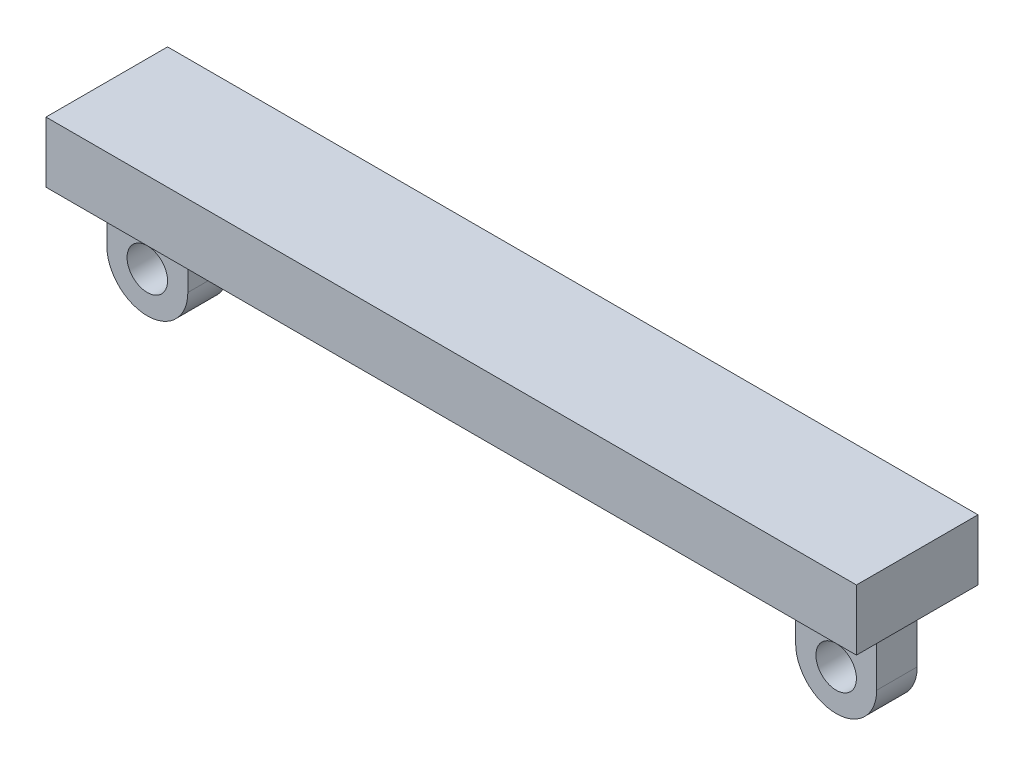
ISO-10303-21;
HEADER;
FILE_DESCRIPTION(('STEP AP214'),'2;1');
FILE_NAME('part.step','',(''),(''),'','','');
FILE_SCHEMA(('AUTOMOTIVE_DESIGN { 1 0 10303 214 1 1 1 1 }'));
ENDSEC;
DATA;
#1=APPLICATION_CONTEXT('core data for automotive mechanical design processes');
#2=APPLICATION_PROTOCOL_DEFINITION('international standard','automotive_design',2000,#1);
#3=PRODUCT_CONTEXT('',#1,'mechanical');
#4=PRODUCT('Part','Part','',(#3));
#5=PRODUCT_RELATED_PRODUCT_CATEGORY('part','',(#4));
#6=PRODUCT_DEFINITION_FORMATION('','',#4);
#7=PRODUCT_DEFINITION_CONTEXT('part definition',#1,'design');
#8=PRODUCT_DEFINITION('design','',#6,#7);
#9=PRODUCT_DEFINITION_SHAPE('','',#8);
#10=(LENGTH_UNIT() NAMED_UNIT(*) SI_UNIT(.MILLI.,.METRE.));
#11=(NAMED_UNIT(*) PLANE_ANGLE_UNIT() SI_UNIT($,.RADIAN.));
#12=(NAMED_UNIT(*) SI_UNIT($,.STERADIAN.) SOLID_ANGLE_UNIT());
#13=UNCERTAINTY_MEASURE_WITH_UNIT(LENGTH_MEASURE(1.E-05),#10,'distance_accuracy_value','');
#14=(GEOMETRIC_REPRESENTATION_CONTEXT(3) GLOBAL_UNCERTAINTY_ASSIGNED_CONTEXT((#13)) GLOBAL_UNIT_ASSIGNED_CONTEXT((#10,
#11,#12)) REPRESENTATION_CONTEXT('',''));
#15=CARTESIAN_POINT('',(0.,0.,0.));
#16=DIRECTION('',(0.,0.,1.));
#17=DIRECTION('',(1.,0.,0.));
#18=AXIS2_PLACEMENT_3D('',#15,#16,#17);
#19=CARTESIAN_POINT('',(190.,-80.,10.));
#20=DIRECTION('',(0.,0.,1.));
#21=DIRECTION('',(1.,0.,0.));
#22=AXIS2_PLACEMENT_3D('',#19,#20,#21);
#23=PLANE('',#22);
#24=DIRECTION('',(0.,1.,0.));
#25=VECTOR('',#24,1.);
#26=CARTESIAN_POINT('',(150.,-80.,10.));
#27=LINE('',#26,#25);
#28=CARTESIAN_POINT('',(150.,-60.,10.));
#29=VERTEX_POINT('',#28);
#30=CARTESIAN_POINT('',(150.,-35.,10.));
#31=VERTEX_POINT('',#30);
#32=EDGE_CURVE('E299',#29,#31,#27,.T.);
#33=ORIENTED_EDGE('',*,*,#32,.F.);
#34=CARTESIAN_POINT('',(170.,-60.,10.));
#35=DIRECTION('',(0.,0.,1.));
#36=DIRECTION('',(1.,0.,0.));
#37=AXIS2_PLACEMENT_3D('',#34,#35,#36);
#38=CIRCLE('',#37,20.);
#39=CARTESIAN_POINT('',(170.,-80.,10.));
#40=VERTEX_POINT('',#39);
#41=EDGE_CURVE('E249',#29,#40,#38,.T.);
#42=ORIENTED_EDGE('',*,*,#41,.T.);
#43=CARTESIAN_POINT('',(170.,-60.,10.));
#44=DIRECTION('',(0.,0.,1.));
#45=DIRECTION('',(1.,0.,0.));
#46=AXIS2_PLACEMENT_3D('',#43,#44,#45);
#47=CIRCLE('',#46,20.);
#48=CARTESIAN_POINT('',(190.,-60.,10.));
#49=VERTEX_POINT('',#48);
#50=EDGE_CURVE('E247',#40,#49,#47,.T.);
#51=ORIENTED_EDGE('',*,*,#50,.T.);
#52=DIRECTION('',(0.,1.,0.));
#53=VECTOR('',#52,1.);
#54=CARTESIAN_POINT('',(190.,-80.,10.));
#55=LINE('',#54,#53);
#56=CARTESIAN_POINT('',(190.,-35.,10.));
#57=VERTEX_POINT('',#56);
#58=EDGE_CURVE('E276',#49,#57,#55,.T.);
#59=ORIENTED_EDGE('',*,*,#58,.T.);
#60=CARTESIAN_POINT('',(195.,-35.,10.));
#61=DIRECTION('',(0.,0.,1.));
#62=DIRECTION('',(1.,0.,0.));
#63=AXIS2_PLACEMENT_3D('',#60,#61,#62);
#64=CIRCLE('',#63,5.);
#65=CARTESIAN_POINT('',(195.,-30.,10.));
#66=VERTEX_POINT('',#65);
#67=EDGE_CURVE('E268',#57,#66,#64,.F.);
#68=ORIENTED_EDGE('',*,*,#67,.T.);
#69=DIRECTION('',(1.,0.,0.));
#70=VECTOR('',#69,1.);
#71=CARTESIAN_POINT('',(190.,-30.,10.));
#72=LINE('',#71,#70);
#73=CARTESIAN_POINT('',(145.,-30.,10.));
#74=VERTEX_POINT('',#73);
#75=EDGE_CURVE('E274',#74,#66,#72,.T.);
#76=ORIENTED_EDGE('',*,*,#75,.F.);
#77=CARTESIAN_POINT('',(145.,-35.,10.));
#78=DIRECTION('',(0.,0.,1.));
#79=DIRECTION('',(1.,0.,0.));
#80=AXIS2_PLACEMENT_3D('',#77,#78,#79);
#81=CIRCLE('',#80,5.);
#82=EDGE_CURVE('E40',#74,#31,#81,.F.);
#83=ORIENTED_EDGE('',*,*,#82,.T.);
#84=EDGE_LOOP('',(#33,#42,#51,#59,#68,#76,#83));
#85=FACE_BOUND('',#84,.T.);
#86=CARTESIAN_POINT('',(170.,-60.,10.));
#87=DIRECTION('',(0.,0.,1.));
#88=DIRECTION('',(1.,0.,0.));
#89=AXIS2_PLACEMENT_3D('',#86,#87,#88);
#90=CIRCLE('',#89,10.);
#91=CARTESIAN_POINT('',(160.,-60.,10.));
#92=VERTEX_POINT('',#91);
#93=EDGE_CURVE('E291',#92,#92,#90,.F.);
#94=ORIENTED_EDGE('',*,*,#93,.T.);
#95=EDGE_LOOP('',(#94));
#96=FACE_BOUND('',#95,.T.);
#97=ADVANCED_FACE('F32',(#85,#96),#23,.T.);
#98=CARTESIAN_POINT('',(190.,-80.,-9.99999999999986));
#99=DIRECTION('',(0.,0.,-1.));
#100=DIRECTION('',(-1.,0.,0.));
#101=AXIS2_PLACEMENT_3D('',#98,#99,#100);
#102=PLANE('',#101);
#103=CARTESIAN_POINT('',(170.,-60.,-9.99999999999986));
#104=DIRECTION('',(0.,0.,-1.));
#105=DIRECTION('',(-1.,0.,0.));
#106=AXIS2_PLACEMENT_3D('',#103,#104,#105);
#107=CIRCLE('',#106,20.);
#108=CARTESIAN_POINT('',(190.,-60.,-9.99999999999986));
#109=VERTEX_POINT('',#108);
#110=CARTESIAN_POINT('',(170.,-80.,-9.99999999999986));
#111=VERTEX_POINT('',#110);
#112=EDGE_CURVE('E251',#109,#111,#107,.T.);
#113=ORIENTED_EDGE('',*,*,#112,.T.);
#114=CARTESIAN_POINT('',(170.,-60.,-9.99999999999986));
#115=DIRECTION('',(0.,0.,-1.));
#116=DIRECTION('',(-1.,0.,0.));
#117=AXIS2_PLACEMENT_3D('',#114,#115,#116);
#118=CIRCLE('',#117,20.);
#119=CARTESIAN_POINT('',(150.,-60.,-9.99999999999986));
#120=VERTEX_POINT('',#119);
#121=EDGE_CURVE('E253',#111,#120,#118,.T.);
#122=ORIENTED_EDGE('',*,*,#121,.T.);
#123=DIRECTION('',(0.,1.,0.));
#124=VECTOR('',#123,1.);
#125=CARTESIAN_POINT('',(150.,-80.,-9.99999999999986));
#126=LINE('',#125,#124);
#127=CARTESIAN_POINT('',(150.,-35.,-9.99999999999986));
#128=VERTEX_POINT('',#127);
#129=EDGE_CURVE('E297',#120,#128,#126,.T.);
#130=ORIENTED_EDGE('',*,*,#129,.T.);
#131=CARTESIAN_POINT('',(145.,-35.,-9.99999999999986));
#132=DIRECTION('',(0.,0.,-1.));
#133=DIRECTION('',(-1.,0.,0.));
#134=AXIS2_PLACEMENT_3D('',#131,#132,#133);
#135=CIRCLE('',#134,5.);
#136=CARTESIAN_POINT('',(145.,-30.,-9.99999999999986));
#137=VERTEX_POINT('',#136);
#138=EDGE_CURVE('E11',#128,#137,#135,.F.);
#139=ORIENTED_EDGE('',*,*,#138,.T.);
#140=DIRECTION('',(-1.,0.,0.));
#141=VECTOR('',#140,1.);
#142=CARTESIAN_POINT('',(190.,-30.,-9.99999999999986));
#143=LINE('',#142,#141);
#144=CARTESIAN_POINT('',(195.,-30.,-9.99999999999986));
#145=VERTEX_POINT('',#144);
#146=EDGE_CURVE('E284',#145,#137,#143,.T.);
#147=ORIENTED_EDGE('',*,*,#146,.F.);
#148=CARTESIAN_POINT('',(195.,-35.,-9.99999999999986));
#149=DIRECTION('',(0.,0.,-1.));
#150=DIRECTION('',(-1.,0.,0.));
#151=AXIS2_PLACEMENT_3D('',#148,#149,#150);
#152=CIRCLE('',#151,5.);
#153=CARTESIAN_POINT('',(190.,-35.,-9.99999999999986));
#154=VERTEX_POINT('',#153);
#155=EDGE_CURVE('E266',#145,#154,#152,.F.);
#156=ORIENTED_EDGE('',*,*,#155,.T.);
#157=DIRECTION('',(0.,1.,0.));
#158=VECTOR('',#157,1.);
#159=CARTESIAN_POINT('',(190.,-80.,-9.99999999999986));
#160=LINE('',#159,#158);
#161=EDGE_CURVE('E288',#109,#154,#160,.T.);
#162=ORIENTED_EDGE('',*,*,#161,.F.);
#163=EDGE_LOOP('',(#113,#122,#130,#139,#147,#156,#162));
#164=FACE_BOUND('',#163,.T.);
#165=CARTESIAN_POINT('',(170.,-60.,-9.99999999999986));
#166=DIRECTION('',(0.,0.,1.));
#167=DIRECTION('',(1.,0.,0.));
#168=AXIS2_PLACEMENT_3D('',#165,#166,#167);
#169=CIRCLE('',#168,10.);
#170=CARTESIAN_POINT('',(160.,-60.,-9.99999999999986));
#171=VERTEX_POINT('',#170);
#172=EDGE_CURVE('E567',#171,#171,#169,.T.);
#173=ORIENTED_EDGE('',*,*,#172,.T.);
#174=EDGE_LOOP('',(#173));
#175=FACE_BOUND('',#174,.T.);
#176=ADVANCED_FACE('F350',(#164,#175),#102,.T.);
#177=CARTESIAN_POINT('',(-200.,-30.,-30.));
#178=DIRECTION('',(0.,1.,0.));
#179=DIRECTION('',(0.,0.,1.));
#180=AXIS2_PLACEMENT_3D('',#177,#178,#179);
#181=PLANE('',#180);
#182=DIRECTION('',(0.,0.,-1.));
#183=VECTOR('',#182,1.);
#184=CARTESIAN_POINT('',(195.,-30.,-29.9999999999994));
#185=LINE('',#184,#183);
#186=EDGE_CURVE('E260',#66,#145,#185,.T.);
#187=ORIENTED_EDGE('',*,*,#186,.T.);
#188=ORIENTED_EDGE('',*,*,#146,.T.);
#189=DIRECTION('',(0.,0.,1.));
#190=VECTOR('',#189,1.);
#191=CARTESIAN_POINT('',(145.,-30.,-30.));
#192=LINE('',#191,#190);
#193=EDGE_CURVE('E257',#137,#74,#192,.T.);
#194=ORIENTED_EDGE('',*,*,#193,.T.);
#195=ORIENTED_EDGE('',*,*,#75,.T.);
#196=EDGE_LOOP('',(#187,#188,#194,#195));
#197=FACE_BOUND('',#196,.T.);
#198=DIRECTION('',(0.,0.,1.));
#199=VECTOR('',#198,1.);
#200=CARTESIAN_POINT('',(-200.,-30.,-30.));
#201=LINE('',#200,#199);
#202=CARTESIAN_POINT('',(-200.,-30.,-30.));
#203=VERTEX_POINT('',#202);
#204=CARTESIAN_POINT('',(-200.,-30.,30.));
#205=VERTEX_POINT('',#204);
#206=EDGE_CURVE('E164',#203,#205,#201,.T.);
#207=ORIENTED_EDGE('',*,*,#206,.F.);
#208=DIRECTION('',(-1.,0.,0.));
#209=VECTOR('',#208,1.);
#210=CARTESIAN_POINT('',(-200.,-30.,-30.));
#211=LINE('',#210,#209);
#212=CARTESIAN_POINT('',(200.,-30.,-30.));
#213=VERTEX_POINT('',#212);
#214=EDGE_CURVE('E169',#213,#203,#211,.T.);
#215=ORIENTED_EDGE('',*,*,#214,.F.);
#216=DIRECTION('',(0.,0.,-1.));
#217=VECTOR('',#216,1.);
#218=CARTESIAN_POINT('',(200.,-30.,-30.));
#219=LINE('',#218,#217);
#220=CARTESIAN_POINT('',(200.,-30.,30.));
#221=VERTEX_POINT('',#220);
#222=EDGE_CURVE('E194',#221,#213,#219,.T.);
#223=ORIENTED_EDGE('',*,*,#222,.F.);
#224=DIRECTION('',(1.,0.,0.));
#225=VECTOR('',#224,1.);
#226=CARTESIAN_POINT('',(-200.,-30.,30.));
#227=LINE('',#226,#225);
#228=EDGE_CURVE('E192',#205,#221,#227,.T.);
#229=ORIENTED_EDGE('',*,*,#228,.F.);
#230=EDGE_LOOP('',(#207,#215,#223,#229));
#231=FACE_BOUND('',#230,.T.);
#232=DIRECTION('',(1.,0.,0.));
#233=VECTOR('',#232,1.);
#234=CARTESIAN_POINT('',(-190.,-30.,-9.99999999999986));
#235=LINE('',#234,#233);
#236=CARTESIAN_POINT('',(-195.,-30.,-9.99999999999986));
#237=VERTEX_POINT('',#236);
#238=CARTESIAN_POINT('',(-145.,-30.,-9.99999999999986));
#239=VERTEX_POINT('',#238);
#240=EDGE_CURVE('E306',#237,#239,#235,.T.);
#241=ORIENTED_EDGE('',*,*,#240,.F.);
#242=DIRECTION('',(0.,0.,-1.));
#243=VECTOR('',#242,1.);
#244=CARTESIAN_POINT('',(-195.,-30.,10.));
#245=LINE('',#244,#243);
#246=CARTESIAN_POINT('',(-195.,-30.,10.));
#247=VERTEX_POINT('',#246);
#248=EDGE_CURVE('E228',#237,#247,#245,.F.);
#249=ORIENTED_EDGE('',*,*,#248,.T.);
#250=DIRECTION('',(-1.,0.,0.));
#251=VECTOR('',#250,1.);
#252=CARTESIAN_POINT('',(-190.,-30.,10.));
#253=LINE('',#252,#251);
#254=CARTESIAN_POINT('',(-145.,-30.,10.));
#255=VERTEX_POINT('',#254);
#256=EDGE_CURVE('E308',#255,#247,#253,.T.);
#257=ORIENTED_EDGE('',*,*,#256,.F.);
#258=DIRECTION('',(0.,0.,1.));
#259=VECTOR('',#258,1.);
#260=CARTESIAN_POINT('',(-145.,-30.,-9.99999999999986));
#261=LINE('',#260,#259);
#262=EDGE_CURVE('E225',#255,#239,#261,.F.);
#263=ORIENTED_EDGE('',*,*,#262,.T.);
#264=EDGE_LOOP('',(#241,#249,#257,#263));
#265=FACE_BOUND('',#264,.T.);
#266=ADVANCED_FACE('F282',(#197,#231,#265),#181,.F.);
#267=CARTESIAN_POINT('',(-200.,-30.,-30.));
#268=DIRECTION('',(-1.,0.,0.));
#269=DIRECTION('',(0.,0.,1.));
#270=AXIS2_PLACEMENT_3D('',#267,#268,#269);
#271=PLANE('',#270);
#272=DIRECTION('',(0.,0.,1.));
#273=VECTOR('',#272,1.);
#274=CARTESIAN_POINT('',(-200.,0.,-30.));
#275=LINE('',#274,#273);
#276=CARTESIAN_POINT('',(-200.,0.,-30.));
#277=VERTEX_POINT('',#276);
#278=CARTESIAN_POINT('',(-200.,0.,30.));
#279=VERTEX_POINT('',#278);
#280=EDGE_CURVE('E161',#277,#279,#275,.T.);
#281=ORIENTED_EDGE('',*,*,#280,.F.);
#282=DIRECTION('',(0.,1.,0.));
#283=VECTOR('',#282,1.);
#284=CARTESIAN_POINT('',(-200.,-30.,-30.));
#285=LINE('',#284,#283);
#286=EDGE_CURVE('E199',#203,#277,#285,.T.);
#287=ORIENTED_EDGE('',*,*,#286,.F.);
#288=ORIENTED_EDGE('',*,*,#206,.T.);
#289=DIRECTION('',(0.,1.,0.));
#290=VECTOR('',#289,1.);
#291=CARTESIAN_POINT('',(-200.,-30.,30.));
#292=LINE('',#291,#290);
#293=EDGE_CURVE('E158',#205,#279,#292,.T.);
#294=ORIENTED_EDGE('',*,*,#293,.T.);
#295=EDGE_LOOP('',(#281,#287,#288,#294));
#296=FACE_BOUND('',#295,.T.);
#297=ADVANCED_FACE('F34',(#296),#271,.T.);
#298=CARTESIAN_POINT('',(-200.,-30.,-30.));
#299=DIRECTION('',(0.,0.,-1.));
#300=DIRECTION('',(-1.,0.,0.));
#301=AXIS2_PLACEMENT_3D('',#298,#299,#300);
#302=PLANE('',#301);
#303=DIRECTION('',(-1.,0.,0.));
#304=VECTOR('',#303,1.);
#305=CARTESIAN_POINT('',(-200.,0.,-30.));
#306=LINE('',#305,#304);
#307=CARTESIAN_POINT('',(200.,0.,-30.));
#308=VERTEX_POINT('',#307);
#309=EDGE_CURVE('E181',#308,#277,#306,.T.);
#310=ORIENTED_EDGE('',*,*,#309,.F.);
#311=DIRECTION('',(0.,1.,0.));
#312=VECTOR('',#311,1.);
#313=CARTESIAN_POINT('',(200.,-30.,-30.));
#314=LINE('',#313,#312);
#315=EDGE_CURVE('E202',#213,#308,#314,.T.);
#316=ORIENTED_EDGE('',*,*,#315,.F.);
#317=ORIENTED_EDGE('',*,*,#214,.T.);
#318=ORIENTED_EDGE('',*,*,#286,.T.);
#319=EDGE_LOOP('',(#310,#316,#317,#318));
#320=FACE_BOUND('',#319,.T.);
#321=ADVANCED_FACE('F356',(#320),#302,.T.);
#322=CARTESIAN_POINT('',(200.,-30.,-30.));
#323=DIRECTION('',(1.,0.,0.));
#324=DIRECTION('',(0.,0.,-1.));
#325=AXIS2_PLACEMENT_3D('',#322,#323,#324);
#326=PLANE('',#325);
#327=DIRECTION('',(0.,0.,-1.));
#328=VECTOR('',#327,1.);
#329=CARTESIAN_POINT('',(200.,0.,-30.));
#330=LINE('',#329,#328);
#331=CARTESIAN_POINT('',(200.,0.,30.));
#332=VERTEX_POINT('',#331);
#333=EDGE_CURVE('E177',#332,#308,#330,.T.);
#334=ORIENTED_EDGE('',*,*,#333,.F.);
#335=DIRECTION('',(0.,1.,0.));
#336=VECTOR('',#335,1.);
#337=CARTESIAN_POINT('',(200.,-30.,30.));
#338=LINE('',#337,#336);
#339=EDGE_CURVE('E168',#221,#332,#338,.T.);
#340=ORIENTED_EDGE('',*,*,#339,.F.);
#341=ORIENTED_EDGE('',*,*,#222,.T.);
#342=ORIENTED_EDGE('',*,*,#315,.T.);
#343=EDGE_LOOP('',(#334,#340,#341,#342));
#344=FACE_BOUND('',#343,.T.);
#345=ADVANCED_FACE('F397',(#344),#326,.T.);
#346=CARTESIAN_POINT('',(-200.,-30.,30.));
#347=DIRECTION('',(0.,0.,1.));
#348=DIRECTION('',(1.,0.,0.));
#349=AXIS2_PLACEMENT_3D('',#346,#347,#348);
#350=PLANE('',#349);
#351=DIRECTION('',(1.,0.,0.));
#352=VECTOR('',#351,1.);
#353=CARTESIAN_POINT('',(-200.,0.,30.));
#354=LINE('',#353,#352);
#355=EDGE_CURVE('E172',#279,#332,#354,.T.);
#356=ORIENTED_EDGE('',*,*,#355,.F.);
#357=ORIENTED_EDGE('',*,*,#293,.F.);
#358=ORIENTED_EDGE('',*,*,#228,.T.);
#359=ORIENTED_EDGE('',*,*,#339,.T.);
#360=EDGE_LOOP('',(#356,#357,#358,#359));
#361=FACE_BOUND('',#360,.T.);
#362=ADVANCED_FACE('F173',(#361),#350,.T.);
#363=CARTESIAN_POINT('',(-200.,0.,-30.));
#364=DIRECTION('',(0.,1.,0.));
#365=DIRECTION('',(0.,0.,1.));
#366=AXIS2_PLACEMENT_3D('',#363,#364,#365);
#367=PLANE('',#366);
#368=ORIENTED_EDGE('',*,*,#280,.T.);
#369=ORIENTED_EDGE('',*,*,#355,.T.);
#370=ORIENTED_EDGE('',*,*,#333,.T.);
#371=ORIENTED_EDGE('',*,*,#309,.T.);
#372=EDGE_LOOP('',(#368,#369,#370,#371));
#373=FACE_BOUND('',#372,.T.);
#374=ADVANCED_FACE('F179',(#373),#367,.T.);
#375=CARTESIAN_POINT('',(-190.,-80.,-9.99999999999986));
#376=DIRECTION('',(1.,0.,0.));
#377=DIRECTION('',(0.,0.,-1.));
#378=AXIS2_PLACEMENT_3D('',#375,#376,#377);
#379=PLANE('',#378);
#380=DIRECTION('',(0.,1.,0.));
#381=VECTOR('',#380,1.);
#382=CARTESIAN_POINT('',(-190.,-80.,10.));
#383=LINE('',#382,#381);
#384=CARTESIAN_POINT('',(-190.,-60.,10.));
#385=VERTEX_POINT('',#384);
#386=CARTESIAN_POINT('',(-190.,-35.,10.));
#387=VERTEX_POINT('',#386);
#388=EDGE_CURVE('E310',#385,#387,#383,.T.);
#389=ORIENTED_EDGE('',*,*,#388,.T.);
#390=DIRECTION('',(0.,0.,-1.));
#391=VECTOR('',#390,1.);
#392=CARTESIAN_POINT('',(-190.,-35.,-9.99999999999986));
#393=LINE('',#392,#391);
#394=CARTESIAN_POINT('',(-190.,-35.,-9.99999999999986));
#395=VERTEX_POINT('',#394);
#396=EDGE_CURVE('E217',#387,#395,#393,.T.);
#397=ORIENTED_EDGE('',*,*,#396,.T.);
#398=DIRECTION('',(0.,1.,0.));
#399=VECTOR('',#398,1.);
#400=CARTESIAN_POINT('',(-190.,-80.,-9.99999999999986));
#401=LINE('',#400,#399);
#402=CARTESIAN_POINT('',(-190.,-60.,-9.99999999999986));
#403=VERTEX_POINT('',#402);
#404=EDGE_CURVE('E182',#403,#395,#401,.T.);
#405=ORIENTED_EDGE('',*,*,#404,.F.);
#406=DIRECTION('',(0.,0.,-1.));
#407=VECTOR('',#406,1.);
#408=CARTESIAN_POINT('',(-190.,-60.,-9.99999999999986));
#409=LINE('',#408,#407);
#410=EDGE_CURVE('E215',#403,#385,#409,.F.);
#411=ORIENTED_EDGE('',*,*,#410,.T.);
#412=EDGE_LOOP('',(#389,#397,#405,#411));
#413=FACE_BOUND('',#412,.T.);
#414=ADVANCED_FACE('F342',(#413),#379,.F.);
#415=CARTESIAN_POINT('',(-190.,-80.,-9.99999999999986));
#416=DIRECTION('',(0.,0.,1.));
#417=DIRECTION('',(1.,0.,0.));
#418=AXIS2_PLACEMENT_3D('',#415,#416,#417);
#419=PLANE('',#418);
#420=CARTESIAN_POINT('',(-170.,-60.,-9.99999999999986));
#421=DIRECTION('',(0.,0.,-1.));
#422=DIRECTION('',(-1.,0.,0.));
#423=AXIS2_PLACEMENT_3D('',#420,#421,#422);
#424=CIRCLE('',#423,10.);
#425=CARTESIAN_POINT('',(-180.,-60.,-9.99999999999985));
#426=VERTEX_POINT('',#425);
#427=EDGE_CURVE('E222',#426,#426,#424,.T.);
#428=ORIENTED_EDGE('',*,*,#427,.F.);
#429=EDGE_LOOP('',(#428));
#430=FACE_BOUND('',#429,.T.);
#431=DIRECTION('',(0.,1.,0.));
#432=VECTOR('',#431,1.);
#433=CARTESIAN_POINT('',(-150.,-80.,-9.99999999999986));
#434=LINE('',#433,#432);
#435=CARTESIAN_POINT('',(-150.,-60.,-9.99999999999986));
#436=VERTEX_POINT('',#435);
#437=CARTESIAN_POINT('',(-150.,-35.,-9.99999999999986));
#438=VERTEX_POINT('',#437);
#439=EDGE_CURVE('E185',#436,#438,#434,.T.);
#440=ORIENTED_EDGE('',*,*,#439,.F.);
#441=CARTESIAN_POINT('',(-170.,-60.,-9.99999999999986));
#442=DIRECTION('',(0.,0.,1.));
#443=DIRECTION('',(1.,0.,0.));
#444=AXIS2_PLACEMENT_3D('',#441,#442,#443);
#445=CIRCLE('',#444,20.);
#446=CARTESIAN_POINT('',(-170.,-80.,-9.99999999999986));
#447=VERTEX_POINT('',#446);
#448=EDGE_CURVE('E213',#436,#447,#445,.F.);
#449=ORIENTED_EDGE('',*,*,#448,.T.);
#450=CARTESIAN_POINT('',(-170.,-60.,-9.99999999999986));
#451=DIRECTION('',(0.,0.,1.));
#452=DIRECTION('',(1.,0.,0.));
#453=AXIS2_PLACEMENT_3D('',#450,#451,#452);
#454=CIRCLE('',#453,20.);
#455=EDGE_CURVE('E211',#447,#403,#454,.F.);
#456=ORIENTED_EDGE('',*,*,#455,.T.);
#457=ORIENTED_EDGE('',*,*,#404,.T.);
#458=CARTESIAN_POINT('',(-195.,-35.,-9.99999999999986));
#459=DIRECTION('',(0.,0.,1.));
#460=DIRECTION('',(1.,0.,0.));
#461=AXIS2_PLACEMENT_3D('',#458,#459,#460);
#462=CIRCLE('',#461,5.);
#463=EDGE_CURVE('E234',#395,#237,#462,.T.);
#464=ORIENTED_EDGE('',*,*,#463,.T.);
#465=ORIENTED_EDGE('',*,*,#240,.T.);
#466=CARTESIAN_POINT('',(-145.,-35.,-9.99999999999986));
#467=DIRECTION('',(0.,0.,1.));
#468=DIRECTION('',(1.,0.,0.));
#469=AXIS2_PLACEMENT_3D('',#466,#467,#468);
#470=CIRCLE('',#469,5.);
#471=EDGE_CURVE('E242',#239,#438,#470,.T.);
#472=ORIENTED_EDGE('',*,*,#471,.T.);
#473=EDGE_LOOP('',(#440,#449,#456,#457,#464,#465,#472));
#474=FACE_BOUND('',#473,.T.);
#475=ADVANCED_FACE('F334',(#430,#474),#419,.F.);
#476=CARTESIAN_POINT('',(-150.,-80.,-9.99999999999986));
#477=DIRECTION('',(-1.,0.,0.));
#478=DIRECTION('',(0.,0.,1.));
#479=AXIS2_PLACEMENT_3D('',#476,#477,#478);
#480=PLANE('',#479);
#481=ORIENTED_EDGE('',*,*,#439,.T.);
#482=DIRECTION('',(0.,0.,1.));
#483=VECTOR('',#482,1.);
#484=CARTESIAN_POINT('',(-150.,-35.,10.));
#485=LINE('',#484,#483);
#486=CARTESIAN_POINT('',(-150.,-35.,10.));
#487=VERTEX_POINT('',#486);
#488=EDGE_CURVE('E231',#438,#487,#485,.T.);
#489=ORIENTED_EDGE('',*,*,#488,.T.);
#490=DIRECTION('',(0.,1.,0.));
#491=VECTOR('',#490,1.);
#492=CARTESIAN_POINT('',(-150.,-80.,10.));
#493=LINE('',#492,#491);
#494=CARTESIAN_POINT('',(-150.,-60.,10.));
#495=VERTEX_POINT('',#494);
#496=EDGE_CURVE('E313',#495,#487,#493,.T.);
#497=ORIENTED_EDGE('',*,*,#496,.F.);
#498=DIRECTION('',(0.,0.,1.));
#499=VECTOR('',#498,1.);
#500=CARTESIAN_POINT('',(-150.,-60.,-9.99999999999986));
#501=LINE('',#500,#499);
#502=EDGE_CURVE('E208',#495,#436,#501,.F.);
#503=ORIENTED_EDGE('',*,*,#502,.T.);
#504=EDGE_LOOP('',(#481,#489,#497,#503));
#505=FACE_BOUND('',#504,.T.);
#506=ADVANCED_FACE('F319',(#505),#480,.F.);
#507=CARTESIAN_POINT('',(-190.,-80.,10.));
#508=DIRECTION('',(0.,0.,-1.));
#509=DIRECTION('',(-1.,0.,0.));
#510=AXIS2_PLACEMENT_3D('',#507,#508,#509);
#511=PLANE('',#510);
#512=CARTESIAN_POINT('',(-170.,-60.,10.));
#513=DIRECTION('',(0.,0.,-1.));
#514=DIRECTION('',(-1.,0.,0.));
#515=AXIS2_PLACEMENT_3D('',#512,#513,#514);
#516=CIRCLE('',#515,10.);
#517=CARTESIAN_POINT('',(-180.,-60.,10.));
#518=VERTEX_POINT('',#517);
#519=EDGE_CURVE('E218',#518,#518,#516,.T.);
#520=ORIENTED_EDGE('',*,*,#519,.T.);
#521=EDGE_LOOP('',(#520));
#522=FACE_BOUND('',#521,.T.);
#523=CARTESIAN_POINT('',(-170.,-60.,10.));
#524=DIRECTION('',(0.,0.,-1.));
#525=DIRECTION('',(-1.,0.,0.));
#526=AXIS2_PLACEMENT_3D('',#523,#524,#525);
#527=CIRCLE('',#526,20.);
#528=CARTESIAN_POINT('',(-170.,-80.,10.));
#529=VERTEX_POINT('',#528);
#530=EDGE_CURVE('E201',#385,#529,#527,.F.);
#531=ORIENTED_EDGE('',*,*,#530,.T.);
#532=CARTESIAN_POINT('',(-170.,-60.,10.));
#533=DIRECTION('',(0.,0.,-1.));
#534=DIRECTION('',(-1.,0.,0.));
#535=AXIS2_PLACEMENT_3D('',#532,#533,#534);
#536=CIRCLE('',#535,20.);
#537=EDGE_CURVE('E206',#529,#495,#536,.F.);
#538=ORIENTED_EDGE('',*,*,#537,.T.);
#539=ORIENTED_EDGE('',*,*,#496,.T.);
#540=CARTESIAN_POINT('',(-145.,-35.,10.));
#541=DIRECTION('',(0.,0.,-1.));
#542=DIRECTION('',(-1.,0.,0.));
#543=AXIS2_PLACEMENT_3D('',#540,#541,#542);
#544=CIRCLE('',#543,5.);
#545=EDGE_CURVE('E239',#487,#255,#544,.T.);
#546=ORIENTED_EDGE('',*,*,#545,.T.);
#547=ORIENTED_EDGE('',*,*,#256,.T.);
#548=CARTESIAN_POINT('',(-195.,-35.,10.));
#549=DIRECTION('',(0.,0.,-1.));
#550=DIRECTION('',(-1.,0.,0.));
#551=AXIS2_PLACEMENT_3D('',#548,#549,#550);
#552=CIRCLE('',#551,5.);
#553=EDGE_CURVE('E237',#247,#387,#552,.T.);
#554=ORIENTED_EDGE('',*,*,#553,.T.);
#555=ORIENTED_EDGE('',*,*,#388,.F.);
#556=EDGE_LOOP('',(#531,#538,#539,#546,#547,#554,#555));
#557=FACE_BOUND('',#556,.T.);
#558=ADVANCED_FACE('F328',(#522,#557),#511,.F.);
#559=CARTESIAN_POINT('',(-170.,-60.,9.99999999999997));
#560=DIRECTION('',(0.,0.,-1.));
#561=DIRECTION('',(-1.,0.,0.));
#562=AXIS2_PLACEMENT_3D('',#559,#560,#561);
#563=CYLINDRICAL_SURFACE('',#562,20.);
#564=ORIENTED_EDGE('',*,*,#410,.F.);
#565=ORIENTED_EDGE('',*,*,#455,.F.);
#566=DIRECTION('',(0.,0.,-1.));
#567=VECTOR('',#566,1.);
#568=CARTESIAN_POINT('',(-170.,-80.,9.99999999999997));
#569=LINE('',#568,#567);
#570=EDGE_CURVE('E221',#529,#447,#569,.T.);
#571=ORIENTED_EDGE('',*,*,#570,.F.);
#572=ORIENTED_EDGE('',*,*,#530,.F.);
#573=EDGE_LOOP('',(#564,#565,#571,#572));
#574=FACE_BOUND('',#573,.T.);
#575=ADVANCED_FACE('F338',(#574),#563,.T.);
#576=CARTESIAN_POINT('',(-170.,-60.,10.));
#577=DIRECTION('',(0.,0.,1.));
#578=DIRECTION('',(1.,0.,0.));
#579=AXIS2_PLACEMENT_3D('',#576,#577,#578);
#580=CYLINDRICAL_SURFACE('',#579,20.);
#581=ORIENTED_EDGE('',*,*,#448,.F.);
#582=ORIENTED_EDGE('',*,*,#502,.F.);
#583=ORIENTED_EDGE('',*,*,#537,.F.);
#584=ORIENTED_EDGE('',*,*,#570,.T.);
#585=EDGE_LOOP('',(#581,#582,#583,#584));
#586=FACE_BOUND('',#585,.T.);
#587=ADVANCED_FACE('F331',(#586),#580,.T.);
#588=CARTESIAN_POINT('',(-170.,-60.,30.));
#589=DIRECTION('',(0.,0.,-1.));
#590=DIRECTION('',(-1.,0.,0.));
#591=AXIS2_PLACEMENT_3D('',#588,#589,#590);
#592=CYLINDRICAL_SURFACE('',#591,10.);
#593=CARTESIAN_POINT('',(-180.,-60.,-9.99999999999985));
#594=CARTESIAN_POINT('',(-180.,-60.,-9.79166666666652));
#595=CARTESIAN_POINT('',(-180.,-60.,-9.58333333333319));
#596=CARTESIAN_POINT('',(-180.,-60.,-9.16666666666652));
#597=CARTESIAN_POINT('',(-180.,-60.,-8.95833333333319));
#598=CARTESIAN_POINT('',(-180.,-60.,-8.54166666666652));
#599=CARTESIAN_POINT('',(-180.,-60.,-8.33333333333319));
#600=CARTESIAN_POINT('',(-180.,-60.,-7.91666666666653));
#601=CARTESIAN_POINT('',(-180.,-60.,-7.7083333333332));
#602=CARTESIAN_POINT('',(-180.,-60.,-7.29166666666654));
#603=CARTESIAN_POINT('',(-180.,-60.,-7.08333333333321));
#604=CARTESIAN_POINT('',(-180.,-60.,-6.66666666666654));
#605=CARTESIAN_POINT('',(-180.,-60.,-6.45833333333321));
#606=CARTESIAN_POINT('',(-180.,-60.,-6.04166666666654));
#607=CARTESIAN_POINT('',(-180.,-60.,-5.83333333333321));
#608=CARTESIAN_POINT('',(-180.,-60.,-5.41666666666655));
#609=CARTESIAN_POINT('',(-180.,-60.,-5.20833333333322));
#610=CARTESIAN_POINT('',(-180.,-60.,-4.79166666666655));
#611=CARTESIAN_POINT('',(-180.,-60.,-4.58333333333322));
#612=CARTESIAN_POINT('',(-180.,-60.,-4.16666666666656));
#613=CARTESIAN_POINT('',(-180.,-60.,-3.95833333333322));
#614=CARTESIAN_POINT('',(-180.,-60.,-3.54166666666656));
#615=CARTESIAN_POINT('',(-180.,-60.,-3.33333333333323));
#616=CARTESIAN_POINT('',(-180.,-60.,-2.91666666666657));
#617=CARTESIAN_POINT('',(-180.,-60.,-2.70833333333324));
#618=CARTESIAN_POINT('',(-180.,-60.,-2.29166666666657));
#619=CARTESIAN_POINT('',(-180.,-60.,-2.08333333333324));
#620=CARTESIAN_POINT('',(-180.,-60.,-1.66666666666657));
#621=CARTESIAN_POINT('',(-180.,-60.,-1.45833333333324));
#622=CARTESIAN_POINT('',(-180.,-60.,-1.04166666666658));
#623=CARTESIAN_POINT('',(-180.,-60.,-0.833333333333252));
#624=CARTESIAN_POINT('',(-180.,-60.,-0.416666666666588));
#625=CARTESIAN_POINT('',(-180.,-60.,-0.208333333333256));
#626=CARTESIAN_POINT('',(-180.,-60.,0.208333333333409));
#627=CARTESIAN_POINT('',(-180.,-60.,0.416666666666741));
#628=CARTESIAN_POINT('',(-180.,-60.,0.833333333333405));
#629=CARTESIAN_POINT('',(-180.,-60.,1.04166666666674));
#630=CARTESIAN_POINT('',(-180.,-60.,1.4583333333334));
#631=CARTESIAN_POINT('',(-180.,-60.,1.66666666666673));
#632=CARTESIAN_POINT('',(-180.,-60.,2.08333333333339));
#633=CARTESIAN_POINT('',(-180.,-60.,2.29166666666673));
#634=CARTESIAN_POINT('',(-180.,-60.,2.70833333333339));
#635=CARTESIAN_POINT('',(-180.,-60.,2.91666666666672));
#636=CARTESIAN_POINT('',(-180.,-60.,3.33333333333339));
#637=CARTESIAN_POINT('',(-180.,-60.,3.54166666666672));
#638=CARTESIAN_POINT('',(-180.,-60.,3.95833333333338));
#639=CARTESIAN_POINT('',(-180.,-60.,4.16666666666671));
#640=CARTESIAN_POINT('',(-180.,-60.,4.58333333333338));
#641=CARTESIAN_POINT('',(-180.,-60.,4.79166666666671));
#642=CARTESIAN_POINT('',(-180.,-60.,5.20833333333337));
#643=CARTESIAN_POINT('',(-180.,-60.,5.41666666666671));
#644=CARTESIAN_POINT('',(-180.,-60.,5.83333333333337));
#645=CARTESIAN_POINT('',(-180.,-60.,6.0416666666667));
#646=CARTESIAN_POINT('',(-180.,-60.,6.45833333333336));
#647=CARTESIAN_POINT('',(-180.,-60.,6.6666666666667));
#648=CARTESIAN_POINT('',(-180.,-60.,7.08333333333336));
#649=CARTESIAN_POINT('',(-180.,-60.,7.29166666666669));
#650=CARTESIAN_POINT('',(-180.,-60.,7.70833333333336));
#651=CARTESIAN_POINT('',(-180.,-60.,7.91666666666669));
#652=CARTESIAN_POINT('',(-180.,-60.,8.33333333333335));
#653=CARTESIAN_POINT('',(-180.,-60.,8.54166666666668));
#654=CARTESIAN_POINT('',(-180.,-60.,8.95833333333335));
#655=CARTESIAN_POINT('',(-180.,-60.,9.16666666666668));
#656=CARTESIAN_POINT('',(-180.,-60.,9.58333333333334));
#657=CARTESIAN_POINT('',(-180.,-60.,9.79166666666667));
#658=CARTESIAN_POINT('',(-180.,-60.,10.));
#659=B_SPLINE_CURVE_WITH_KNOTS('',3,(#593,#594,#595,#596,#597,#598,#599,#600,#601,#602,#603,
#604,#605,#606,#607,#608,#609,#610,#611,#612,#613,#614,#615,#616,#617,#618,#619,#620,#621,#622,
#623,#624,#625,#626,#627,#628,#629,#630,#631,#632,#633,#634,#635,#636,#637,#638,#639,#640,#641,
#642,#643,#644,#645,#646,#647,#648,#649,#650,#651,#652,#653,#654,#655,#656,#657,#658),
.UNSPECIFIED.,.F.,.F.,(4,2,2,2,2,2,2,2,2,2,2,2,2,2,2,2,2,2,2,2,2,2,2,2,2,2,2,2,2,2,2,2,4),(0.,
0.624999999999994,1.24999999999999,1.87499999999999,2.49999999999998,3.12499999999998,
3.74999999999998,4.37499999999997,4.99999999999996,5.62499999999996,6.24999999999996,
6.87499999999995,7.49999999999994,8.12499999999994,8.74999999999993,9.37499999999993,
9.99999999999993,10.6249999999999,11.2499999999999,11.8749999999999,12.4999999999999,
13.1249999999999,13.7499999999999,14.3749999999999,14.9999999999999,15.6249999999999,
16.2499999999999,16.8749999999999,17.4999999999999,18.1249999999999,18.7499999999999,
19.3749999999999,19.9999999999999),.UNSPECIFIED.);
#660=EDGE_CURVE('BSEAM376',#426,#518,#659,.T.);
#661=ORIENTED_EDGE('',*,*,#427,.T.);
#662=ORIENTED_EDGE('',*,*,#519,.F.);
#663=ORIENTED_EDGE('',*,*,#660,.T.);
#664=ORIENTED_EDGE('',*,*,#660,.F.);
#665=EDGE_LOOP('',(#661,#663,#662,#664));
#666=FACE_BOUND('',#665,.T.);
#667=ADVANCED_FACE('F376',(#666),#592,.F.);
#668=CARTESIAN_POINT('',(-195.,-35.,-9.99999999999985));
#669=DIRECTION('',(0.,0.,1.));
#670=DIRECTION('',(1.,0.,0.));
#671=AXIS2_PLACEMENT_3D('',#668,#669,#670);
#672=CYLINDRICAL_SURFACE('',#671,5.);
#673=ORIENTED_EDGE('',*,*,#553,.F.);
#674=ORIENTED_EDGE('',*,*,#248,.F.);
#675=ORIENTED_EDGE('',*,*,#463,.F.);
#676=ORIENTED_EDGE('',*,*,#396,.F.);
#677=EDGE_LOOP('',(#673,#674,#675,#676));
#678=FACE_BOUND('',#677,.T.);
#679=ADVANCED_FACE('F347',(#678),#672,.F.);
#680=CARTESIAN_POINT('',(-145.,-35.,-9.99999999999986));
#681=DIRECTION('',(0.,0.,-1.));
#682=DIRECTION('',(-1.,0.,0.));
#683=AXIS2_PLACEMENT_3D('',#680,#681,#682);
#684=CYLINDRICAL_SURFACE('',#683,5.);
#685=ORIENTED_EDGE('',*,*,#471,.F.);
#686=ORIENTED_EDGE('',*,*,#262,.F.);
#687=ORIENTED_EDGE('',*,*,#545,.F.);
#688=ORIENTED_EDGE('',*,*,#488,.F.);
#689=EDGE_LOOP('',(#685,#686,#687,#688));
#690=FACE_BOUND('',#689,.T.);
#691=ADVANCED_FACE('F325',(#690),#684,.F.);
#692=CARTESIAN_POINT('',(190.,-80.,-9.99999999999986));
#693=DIRECTION('',(1.,0.,0.));
#694=DIRECTION('',(0.,0.,-1.));
#695=AXIS2_PLACEMENT_3D('',#692,#693,#694);
#696=PLANE('',#695);
#697=ORIENTED_EDGE('',*,*,#161,.T.);
#698=DIRECTION('',(0.,0.,-1.));
#699=VECTOR('',#698,1.);
#700=CARTESIAN_POINT('',(190.,-35.,-9.99999999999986));
#701=LINE('',#700,#699);
#702=EDGE_CURVE('E263',#154,#57,#701,.F.);
#703=ORIENTED_EDGE('',*,*,#702,.T.);
#704=ORIENTED_EDGE('',*,*,#58,.F.);
#705=DIRECTION('',(0.,0.,-1.));
#706=VECTOR('',#705,1.);
#707=CARTESIAN_POINT('',(190.,-60.,-9.99999999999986));
#708=LINE('',#707,#706);
#709=EDGE_CURVE('E255',#49,#109,#708,.T.);
#710=ORIENTED_EDGE('',*,*,#709,.T.);
#711=EDGE_LOOP('',(#697,#703,#704,#710));
#712=FACE_BOUND('',#711,.T.);
#713=ADVANCED_FACE('F368',(#712),#696,.T.);
#714=CARTESIAN_POINT('',(150.,-80.,-9.99999999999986));
#715=DIRECTION('',(-1.,0.,0.));
#716=DIRECTION('',(0.,0.,1.));
#717=AXIS2_PLACEMENT_3D('',#714,#715,#716);
#718=PLANE('',#717);
#719=ORIENTED_EDGE('',*,*,#32,.T.);
#720=DIRECTION('',(0.,0.,1.));
#721=VECTOR('',#720,1.);
#722=CARTESIAN_POINT('',(150.,-35.,-9.99999999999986));
#723=LINE('',#722,#721);
#724=EDGE_CURVE('E53',#31,#128,#723,.F.);
#725=ORIENTED_EDGE('',*,*,#724,.T.);
#726=ORIENTED_EDGE('',*,*,#129,.F.);
#727=DIRECTION('',(0.,0.,1.));
#728=VECTOR('',#727,1.);
#729=CARTESIAN_POINT('',(150.,-60.,10.));
#730=LINE('',#729,#728);
#731=EDGE_CURVE('E244',#120,#29,#730,.T.);
#732=ORIENTED_EDGE('',*,*,#731,.T.);
#733=EDGE_LOOP('',(#719,#725,#726,#732));
#734=FACE_BOUND('',#733,.T.);
#735=ADVANCED_FACE('F367',(#734),#718,.T.);
#736=CARTESIAN_POINT('',(170.,-60.,-9.99999999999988));
#737=DIRECTION('',(0.,0.,1.));
#738=DIRECTION('',(1.,0.,0.));
#739=AXIS2_PLACEMENT_3D('',#736,#737,#738);
#740=CYLINDRICAL_SURFACE('',#739,20.);
#741=DIRECTION('',(0.,0.,-1.));
#742=VECTOR('',#741,1.);
#743=CARTESIAN_POINT('',(170.,-80.,9.99999999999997));
#744=LINE('',#743,#742);
#745=EDGE_CURVE('E286',#111,#40,#744,.F.);
#746=ORIENTED_EDGE('',*,*,#745,.F.);
#747=ORIENTED_EDGE('',*,*,#112,.F.);
#748=ORIENTED_EDGE('',*,*,#709,.F.);
#749=ORIENTED_EDGE('',*,*,#50,.F.);
#750=EDGE_LOOP('',(#746,#747,#748,#749));
#751=FACE_BOUND('',#750,.T.);
#752=ADVANCED_FACE('F508',(#751),#740,.T.);
#753=CARTESIAN_POINT('',(170.,-60.,-9.99999999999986));
#754=DIRECTION('',(0.,0.,-1.));
#755=DIRECTION('',(-1.,0.,0.));
#756=AXIS2_PLACEMENT_3D('',#753,#754,#755);
#757=CYLINDRICAL_SURFACE('',#756,20.);
#758=ORIENTED_EDGE('',*,*,#121,.F.);
#759=ORIENTED_EDGE('',*,*,#745,.T.);
#760=ORIENTED_EDGE('',*,*,#41,.F.);
#761=ORIENTED_EDGE('',*,*,#731,.F.);
#762=EDGE_LOOP('',(#758,#759,#760,#761));
#763=FACE_BOUND('',#762,.T.);
#764=ADVANCED_FACE('F516',(#763),#757,.T.);
#765=CARTESIAN_POINT('',(170.,-60.,30.));
#766=DIRECTION('',(0.,0.,-1.));
#767=DIRECTION('',(-1.,0.,0.));
#768=AXIS2_PLACEMENT_3D('',#765,#766,#767);
#769=CYLINDRICAL_SURFACE('',#768,10.);
#770=CARTESIAN_POINT('',(160.,-60.,10.));
#771=CARTESIAN_POINT('',(160.,-60.,9.79166666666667));
#772=CARTESIAN_POINT('',(160.,-60.,9.58333333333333));
#773=CARTESIAN_POINT('',(160.,-60.,9.16666666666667));
#774=CARTESIAN_POINT('',(160.,-60.,8.95833333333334));
#775=CARTESIAN_POINT('',(160.,-60.,8.54166666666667));
#776=CARTESIAN_POINT('',(160.,-60.,8.33333333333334));
#777=CARTESIAN_POINT('',(160.,-60.,7.91666666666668));
#778=CARTESIAN_POINT('',(160.,-60.,7.70833333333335));
#779=CARTESIAN_POINT('',(160.,-60.,7.29166666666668));
#780=CARTESIAN_POINT('',(160.,-60.,7.08333333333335));
#781=CARTESIAN_POINT('',(160.,-60.,6.66666666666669));
#782=CARTESIAN_POINT('',(160.,-60.,6.45833333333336));
#783=CARTESIAN_POINT('',(160.,-60.,6.04166666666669));
#784=CARTESIAN_POINT('',(160.,-60.,5.83333333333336));
#785=CARTESIAN_POINT('',(160.,-60.,5.4166666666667));
#786=CARTESIAN_POINT('',(160.,-60.,5.20833333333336));
#787=CARTESIAN_POINT('',(160.,-60.,4.7916666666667));
#788=CARTESIAN_POINT('',(160.,-60.,4.58333333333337));
#789=CARTESIAN_POINT('',(160.,-60.,4.1666666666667));
#790=CARTESIAN_POINT('',(160.,-60.,3.95833333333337));
#791=CARTESIAN_POINT('',(160.,-60.,3.54166666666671));
#792=CARTESIAN_POINT('',(160.,-60.,3.33333333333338));
#793=CARTESIAN_POINT('',(160.,-60.,2.91666666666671));
#794=CARTESIAN_POINT('',(160.,-60.,2.70833333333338));
#795=CARTESIAN_POINT('',(160.,-60.,2.29166666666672));
#796=CARTESIAN_POINT('',(160.,-60.,2.08333333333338));
#797=CARTESIAN_POINT('',(160.,-60.,1.66666666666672));
#798=CARTESIAN_POINT('',(160.,-60.,1.45833333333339));
#799=CARTESIAN_POINT('',(160.,-60.,1.04166666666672));
#800=CARTESIAN_POINT('',(160.,-60.,0.833333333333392));
#801=CARTESIAN_POINT('',(160.,-60.,0.416666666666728));
#802=CARTESIAN_POINT('',(160.,-60.,0.208333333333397));
#803=CARTESIAN_POINT('',(160.,-60.,-0.208333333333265));
#804=CARTESIAN_POINT('',(160.,-60.,-0.416666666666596));
#805=CARTESIAN_POINT('',(160.,-60.,-0.83333333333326));
#806=CARTESIAN_POINT('',(160.,-60.,-1.04166666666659));
#807=CARTESIAN_POINT('',(160.,-60.,-1.45833333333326));
#808=CARTESIAN_POINT('',(160.,-60.,-1.66666666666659));
#809=CARTESIAN_POINT('',(160.,-60.,-2.08333333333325));
#810=CARTESIAN_POINT('',(160.,-60.,-2.29166666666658));
#811=CARTESIAN_POINT('',(160.,-60.,-2.70833333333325));
#812=CARTESIAN_POINT('',(160.,-60.,-2.91666666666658));
#813=CARTESIAN_POINT('',(160.,-60.,-3.33333333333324));
#814=CARTESIAN_POINT('',(160.,-60.,-3.54166666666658));
#815=CARTESIAN_POINT('',(160.,-60.,-3.95833333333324));
#816=CARTESIAN_POINT('',(160.,-60.,-4.16666666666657));
#817=CARTESIAN_POINT('',(160.,-60.,-4.58333333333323));
#818=CARTESIAN_POINT('',(160.,-60.,-4.79166666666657));
#819=CARTESIAN_POINT('',(160.,-60.,-5.20833333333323));
#820=CARTESIAN_POINT('',(160.,-60.,-5.41666666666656));
#821=CARTESIAN_POINT('',(160.,-60.,-5.83333333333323));
#822=CARTESIAN_POINT('',(160.,-60.,-6.04166666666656));
#823=CARTESIAN_POINT('',(160.,-60.,-6.45833333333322));
#824=CARTESIAN_POINT('',(160.,-60.,-6.66666666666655));
#825=CARTESIAN_POINT('',(160.,-60.,-7.08333333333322));
#826=CARTESIAN_POINT('',(160.,-60.,-7.29166666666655));
#827=CARTESIAN_POINT('',(160.,-60.,-7.70833333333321));
#828=CARTESIAN_POINT('',(160.,-60.,-7.91666666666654));
#829=CARTESIAN_POINT('',(160.,-60.,-8.33333333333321));
#830=CARTESIAN_POINT('',(160.,-60.,-8.54166666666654));
#831=CARTESIAN_POINT('',(160.,-60.,-8.95833333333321));
#832=CARTESIAN_POINT('',(160.,-60.,-9.16666666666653));
#833=CARTESIAN_POINT('',(160.,-60.,-9.5833333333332));
#834=CARTESIAN_POINT('',(160.,-60.,-9.79166666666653));
#835=CARTESIAN_POINT('',(160.,-60.,-9.99999999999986));
#836=B_SPLINE_CURVE_WITH_KNOTS('',3,(#770,#771,#772,#773,#774,#775,#776,#777,#778,#779,#780,
#781,#782,#783,#784,#785,#786,#787,#788,#789,#790,#791,#792,#793,#794,#795,#796,#797,#798,#799,
#800,#801,#802,#803,#804,#805,#806,#807,#808,#809,#810,#811,#812,#813,#814,#815,#816,#817,#818,
#819,#820,#821,#822,#823,#824,#825,#826,#827,#828,#829,#830,#831,#832,#833,#834,#835),
.UNSPECIFIED.,.F.,.F.,(4,2,2,2,2,2,2,2,2,2,2,2,2,2,2,2,2,2,2,2,2,2,2,2,2,2,2,2,2,2,2,2,4),(0.,
0.624999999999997,1.24999999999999,1.87499999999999,2.49999999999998,3.12499999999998,
3.74999999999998,4.37499999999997,4.99999999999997,5.62499999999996,6.24999999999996,
6.87499999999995,7.49999999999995,8.12499999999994,8.74999999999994,9.37499999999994,
9.99999999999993,10.6249999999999,11.2499999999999,11.8749999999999,12.4999999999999,
13.1249999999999,13.7499999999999,14.3749999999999,14.9999999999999,15.6249999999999,
16.2499999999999,16.8749999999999,17.4999999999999,18.1249999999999,18.7499999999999,
19.3749999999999,19.9999999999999),.UNSPECIFIED.);
#837=EDGE_CURVE('BSEAM525',#92,#171,#836,.T.);
#838=ORIENTED_EDGE('',*,*,#93,.F.);
#839=ORIENTED_EDGE('',*,*,#172,.F.);
#840=ORIENTED_EDGE('',*,*,#837,.T.);
#841=ORIENTED_EDGE('',*,*,#837,.F.);
#842=EDGE_LOOP('',(#838,#840,#839,#841));
#843=FACE_BOUND('',#842,.T.);
#844=ADVANCED_FACE('F525',(#843),#769,.F.);
#845=CARTESIAN_POINT('',(195.,-35.,-29.9999999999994));
#846=DIRECTION('',(0.,0.,-1.));
#847=DIRECTION('',(-1.,0.,0.));
#848=AXIS2_PLACEMENT_3D('',#845,#846,#847);
#849=CYLINDRICAL_SURFACE('',#848,5.);
#850=ORIENTED_EDGE('',*,*,#67,.F.);
#851=ORIENTED_EDGE('',*,*,#702,.F.);
#852=ORIENTED_EDGE('',*,*,#155,.F.);
#853=ORIENTED_EDGE('',*,*,#186,.F.);
#854=EDGE_LOOP('',(#850,#851,#852,#853));
#855=FACE_BOUND('',#854,.T.);
#856=ADVANCED_FACE('F280',(#855),#849,.F.);
#857=CARTESIAN_POINT('',(145.,-35.,-30.));
#858=DIRECTION('',(0.,0.,1.));
#859=DIRECTION('',(1.,0.,0.));
#860=AXIS2_PLACEMENT_3D('',#857,#858,#859);
#861=CYLINDRICAL_SURFACE('',#860,5.);
#862=ORIENTED_EDGE('',*,*,#138,.F.);
#863=ORIENTED_EDGE('',*,*,#724,.F.);
#864=ORIENTED_EDGE('',*,*,#82,.F.);
#865=ORIENTED_EDGE('',*,*,#193,.F.);
#866=EDGE_LOOP('',(#862,#863,#864,#865));
#867=FACE_BOUND('',#866,.T.);
#868=ADVANCED_FACE('F543',(#867),#861,.F.);
#869=CLOSED_SHELL('',(#97,#176,#266,#297,#321,#345,#362,#374,#414,#475,#506,#558,#575,#587,#667,
#679,#691,#713,#735,#752,#764,#844,#856,#868));
#870=MANIFOLD_SOLID_BREP('B2',#869);
#871=ADVANCED_BREP_SHAPE_REPRESENTATION('',(#18,#870),#14);
#872=SHAPE_DEFINITION_REPRESENTATION(#9,#871);
ENDSEC;
END-ISO-10303-21;
